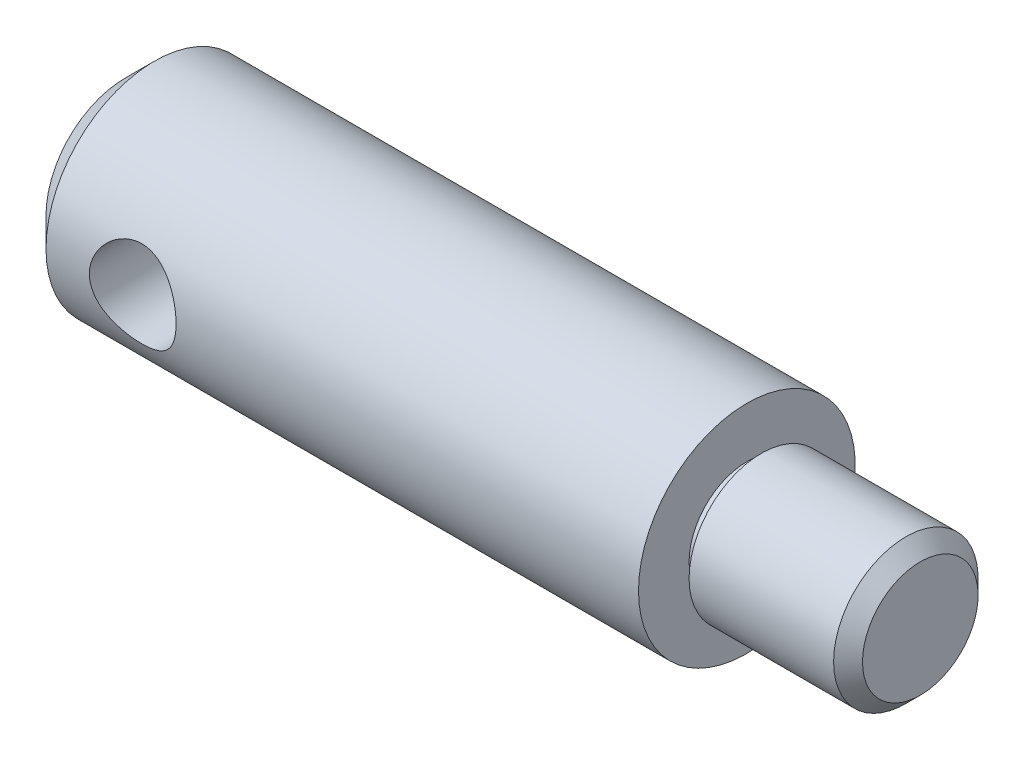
ISO-10303-21;
HEADER;
FILE_DESCRIPTION(('STEP AP214'),'2;1');
FILE_NAME('part.step','',(''),(''),'','','');
FILE_SCHEMA(('AUTOMOTIVE_DESIGN { 1 0 10303 214 1 1 1 1 }'));
ENDSEC;
DATA;
#1=APPLICATION_CONTEXT('core data for automotive mechanical design processes');
#2=APPLICATION_PROTOCOL_DEFINITION('international standard','automotive_design',2000,#1);
#3=PRODUCT_CONTEXT('',#1,'mechanical');
#4=PRODUCT('Part','Part','',(#3));
#5=PRODUCT_RELATED_PRODUCT_CATEGORY('part','',(#4));
#6=PRODUCT_DEFINITION_FORMATION('','',#4);
#7=PRODUCT_DEFINITION_CONTEXT('part definition',#1,'design');
#8=PRODUCT_DEFINITION('design','',#6,#7);
#9=PRODUCT_DEFINITION_SHAPE('','',#8);
#10=(LENGTH_UNIT() NAMED_UNIT(*) SI_UNIT(.MILLI.,.METRE.));
#11=(NAMED_UNIT(*) PLANE_ANGLE_UNIT() SI_UNIT($,.RADIAN.));
#12=(NAMED_UNIT(*) SI_UNIT($,.STERADIAN.) SOLID_ANGLE_UNIT());
#13=UNCERTAINTY_MEASURE_WITH_UNIT(LENGTH_MEASURE(1.E-05),#10,'distance_accuracy_value','');
#14=(GEOMETRIC_REPRESENTATION_CONTEXT(3) GLOBAL_UNCERTAINTY_ASSIGNED_CONTEXT((#13)) GLOBAL_UNIT_ASSIGNED_CONTEXT((#10,
#11,#12)) REPRESENTATION_CONTEXT('',''));
#15=CARTESIAN_POINT('',(0.,0.,0.));
#16=DIRECTION('',(0.,0.,1.));
#17=DIRECTION('',(1.,0.,0.));
#18=AXIS2_PLACEMENT_3D('',#15,#16,#17);
#19=CARTESIAN_POINT('',(55.,0.,0.));
#20=DIRECTION('',(-1.,0.,0.));
#21=DIRECTION('',(0.,0.,1.));
#22=AXIS2_PLACEMENT_3D('',#19,#20,#21);
#23=PLANE('',#22);
#24=CARTESIAN_POINT('',(55.,0.,0.));
#25=DIRECTION('',(-1.,0.,0.));
#26=DIRECTION('',(0.,0.,1.));
#27=AXIS2_PLACEMENT_3D('',#24,#25,#26);
#28=CIRCLE('',#27,3.99999999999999);
#29=CARTESIAN_POINT('',(55.,0.,3.99999999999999));
#30=VERTEX_POINT('',#29);
#31=EDGE_CURVE('E362',#30,#30,#28,.T.);
#32=ORIENTED_EDGE('',*,*,#31,.F.);
#33=EDGE_LOOP('',(#32));
#34=FACE_BOUND('',#33,.T.);
#35=ADVANCED_FACE('F348',(#34),#23,.F.);
#36=CARTESIAN_POINT('',(55.,0.,0.));
#37=DIRECTION('',(-1.,0.,0.));
#38=DIRECTION('',(0.,0.,1.));
#39=AXIS2_PLACEMENT_3D('',#36,#37,#38);
#40=CONICAL_SURFACE('',#39,3.99999999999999,0.78539816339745);
#41=CARTESIAN_POINT('',(54.,0.,0.));
#42=DIRECTION('',(-1.,0.,0.));
#43=DIRECTION('',(0.,0.,1.));
#44=AXIS2_PLACEMENT_3D('',#41,#42,#43);
#45=CIRCLE('',#44,4.99999999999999);
#46=CARTESIAN_POINT('',(54.,0.,4.99999999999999));
#47=VERTEX_POINT('',#46);
#48=EDGE_CURVE('E366',#47,#47,#45,.T.);
#49=ORIENTED_EDGE('',*,*,#48,.F.);
#50=EDGE_LOOP('',(#49));
#51=FACE_BOUND('',#50,.T.);
#52=ORIENTED_EDGE('',*,*,#31,.T.);
#53=EDGE_LOOP('',(#52));
#54=FACE_BOUND('',#53,.T.);
#55=ADVANCED_FACE('F394',(#51,#54),#40,.T.);
#56=CARTESIAN_POINT('',(-44.,0.,0.));
#57=DIRECTION('',(-1.,0.,0.));
#58=DIRECTION('',(0.,0.,1.));
#59=AXIS2_PLACEMENT_3D('',#56,#57,#58);
#60=CYLINDRICAL_SURFACE('',#59,4.99999999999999);
#61=CARTESIAN_POINT('',(44.,0.,0.));
#62=DIRECTION('',(-1.,0.,0.));
#63=DIRECTION('',(0.,0.,1.));
#64=AXIS2_PLACEMENT_3D('',#61,#62,#63);
#65=CIRCLE('',#64,4.99999999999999);
#66=CARTESIAN_POINT('',(44.,0.,4.99999999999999));
#67=VERTEX_POINT('',#66);
#68=EDGE_CURVE('E431',#67,#67,#65,.T.);
#69=ORIENTED_EDGE('',*,*,#68,.F.);
#70=EDGE_LOOP('',(#69));
#71=FACE_BOUND('',#70,.T.);
#72=ORIENTED_EDGE('',*,*,#48,.T.);
#73=EDGE_LOOP('',(#72));
#74=FACE_BOUND('',#73,.T.);
#75=ADVANCED_FACE('F399',(#71,#74),#60,.T.);
#76=CARTESIAN_POINT('',(44.,4.99999999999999,0.));
#77=DIRECTION('',(1.,0.,0.));
#78=DIRECTION('',(0.,0.,-1.));
#79=AXIS2_PLACEMENT_3D('',#76,#77,#78);
#80=PLANE('',#79);
#81=CARTESIAN_POINT('',(44.,0.,0.));
#82=DIRECTION('',(-1.,0.,0.));
#83=DIRECTION('',(0.,0.,1.));
#84=AXIS2_PLACEMENT_3D('',#81,#82,#83);
#85=CIRCLE('',#84,3.99999999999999);
#86=CARTESIAN_POINT('',(44.,0.,3.99999999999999));
#87=VERTEX_POINT('',#86);
#88=EDGE_CURVE('E428',#87,#87,#85,.T.);
#89=ORIENTED_EDGE('',*,*,#88,.F.);
#90=EDGE_LOOP('',(#89));
#91=FACE_BOUND('',#90,.T.);
#92=ORIENTED_EDGE('',*,*,#68,.T.);
#93=EDGE_LOOP('',(#92));
#94=FACE_BOUND('',#93,.T.);
#95=ADVANCED_FACE('F406',(#91,#94),#80,.F.);
#96=CARTESIAN_POINT('',(-44.,0.,0.));
#97=DIRECTION('',(-1.,0.,0.));
#98=DIRECTION('',(0.,0.,1.));
#99=AXIS2_PLACEMENT_3D('',#96,#97,#98);
#100=CYLINDRICAL_SURFACE('',#99,3.99999999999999);
#101=CARTESIAN_POINT('',(43.,0.,0.));
#102=DIRECTION('',(-1.,0.,0.));
#103=DIRECTION('',(0.,0.,1.));
#104=AXIS2_PLACEMENT_3D('',#101,#102,#103);
#105=CIRCLE('',#104,3.99999999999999);
#106=CARTESIAN_POINT('',(43.,0.,3.99999999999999));
#107=VERTEX_POINT('',#106);
#108=EDGE_CURVE('E427',#107,#107,#105,.T.);
#109=ORIENTED_EDGE('',*,*,#108,.F.);
#110=EDGE_LOOP('',(#109));
#111=FACE_BOUND('',#110,.T.);
#112=ORIENTED_EDGE('',*,*,#88,.T.);
#113=EDGE_LOOP('',(#112));
#114=FACE_BOUND('',#113,.T.);
#115=ADVANCED_FACE('F413',(#111,#114),#100,.T.);
#116=CARTESIAN_POINT('',(43.,3.99999999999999,0.));
#117=DIRECTION('',(-1.,0.,0.));
#118=DIRECTION('',(0.,0.,1.));
#119=AXIS2_PLACEMENT_3D('',#116,#117,#118);
#120=PLANE('',#119);
#121=CARTESIAN_POINT('',(43.,0.,0.));
#122=DIRECTION('',(-1.,0.,0.));
#123=DIRECTION('',(0.,0.,1.));
#124=AXIS2_PLACEMENT_3D('',#121,#122,#123);
#125=CIRCLE('',#124,7.5);
#126=CARTESIAN_POINT('',(43.,0.,7.5));
#127=VERTEX_POINT('',#126);
#128=EDGE_CURVE('E424',#127,#127,#125,.T.);
#129=ORIENTED_EDGE('',*,*,#128,.F.);
#130=EDGE_LOOP('',(#129));
#131=FACE_BOUND('',#130,.T.);
#132=ORIENTED_EDGE('',*,*,#108,.T.);
#133=EDGE_LOOP('',(#132));
#134=FACE_BOUND('',#133,.T.);
#135=ADVANCED_FACE('F390',(#131,#134),#120,.F.);
#136=CARTESIAN_POINT('',(-44.,0.,0.));
#137=DIRECTION('',(-1.,0.,0.));
#138=DIRECTION('',(0.,0.,1.));
#139=AXIS2_PLACEMENT_3D('',#136,#137,#138);
#140=CYLINDRICAL_SURFACE('',#139,7.5);
#141=CARTESIAN_POINT('',(11.,0.,-7.5));
#142=CARTESIAN_POINT('',(10.9999983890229,0.0806632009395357,-7.49999888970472));
#143=CARTESIAN_POINT('',(10.99674011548,0.161354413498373,-7.4986936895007));
#144=CARTESIAN_POINT('',(10.9837470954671,0.322146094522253,-7.49351186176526));
#145=CARTESIAN_POINT('',(10.9740082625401,0.402246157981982,-7.48963361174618));
#146=CARTESIAN_POINT('',(10.9351288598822,0.641096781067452,-7.47424634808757));
#147=CARTESIAN_POINT('',(10.8963256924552,0.798158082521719,-7.45898522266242));
#148=CARTESIAN_POINT('',(10.7946857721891,1.10247033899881,-7.42011459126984));
#149=CARTESIAN_POINT('',(10.7319277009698,1.24975157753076,-7.39653243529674));
#150=CARTESIAN_POINT('',(10.584471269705,1.53159737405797,-7.34334877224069));
#151=CARTESIAN_POINT('',(10.4997805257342,1.66616632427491,-7.31374935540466));
#152=CARTESIAN_POINT('',(10.3066467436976,1.92525452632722,-7.24996340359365));
#153=CARTESIAN_POINT('',(10.1973400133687,2.04909421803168,-7.21563448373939));
#154=CARTESIAN_POINT('',(9.95989999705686,2.27726169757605,-7.14690862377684));
#155=CARTESIAN_POINT('',(9.8317575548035,2.38157993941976,-7.11251165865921));
#156=CARTESIAN_POINT('',(9.55335789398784,2.5723120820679,-7.04584188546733));
#157=CARTESIAN_POINT('',(9.40237027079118,2.65772253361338,-7.01373174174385));
#158=CARTESIAN_POINT('',(9.08669540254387,2.80163201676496,-6.95750470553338));
#159=CARTESIAN_POINT('',(8.9220147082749,2.86014383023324,-6.93338401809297));
#160=CARTESIAN_POINT('',(8.59143149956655,2.94584825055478,-6.8973953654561));
#161=CARTESIAN_POINT('',(8.42592314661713,2.974340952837,-6.88502130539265));
#162=CARTESIAN_POINT('',(8.09204750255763,3.00325943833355,-6.87246006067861));
#163=CARTESIAN_POINT('',(7.92368165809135,3.00369902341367,-6.87226688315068));
#164=CARTESIAN_POINT('',(7.60136499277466,2.97748405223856,-6.88365750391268));
#165=CARTESIAN_POINT('',(7.44722642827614,2.95271297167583,-6.89442262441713));
#166=CARTESIAN_POINT('',(7.14551066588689,2.87992032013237,-6.92514281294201));
#167=CARTESIAN_POINT('',(6.99793461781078,2.83189469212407,-6.94509948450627));
#168=CARTESIAN_POINT('',(6.70997324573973,2.71304209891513,-6.99239227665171));
#169=CARTESIAN_POINT('',(6.56979614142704,2.64176979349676,-7.01987068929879));
#170=CARTESIAN_POINT('',(6.30287627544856,2.47875969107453,-7.07907174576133));
#171=CARTESIAN_POINT('',(6.17613858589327,2.38701420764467,-7.1107959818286));
#172=CARTESIAN_POINT('',(5.92938540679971,2.17732589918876,-7.17790105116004));
#173=CARTESIAN_POINT('',(5.8106469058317,2.05790619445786,-7.21337497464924));
#174=CARTESIAN_POINT('',(5.59447328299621,1.80047164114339,-7.28189737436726));
#175=CARTESIAN_POINT('',(5.49704240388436,1.66245309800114,-7.31494536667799));
#176=CARTESIAN_POINT('',(5.32457382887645,1.36811647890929,-7.37572021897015));
#177=CARTESIAN_POINT('',(5.25001657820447,1.21149073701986,-7.40332905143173));
#178=CARTESIAN_POINT('',(5.12874820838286,0.886535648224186,-7.44922242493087));
#179=CARTESIAN_POINT('',(5.08202294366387,0.718212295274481,-7.4675117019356));
#180=CARTESIAN_POINT('',(5.02032755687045,0.385343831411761,-7.49184209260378));
#181=CARTESIAN_POINT('',(5.00364131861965,0.221164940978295,-7.49854418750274));
#182=CARTESIAN_POINT('',(4.99743034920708,-0.107767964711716,-7.50102717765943));
#183=CARTESIAN_POINT('',(5.00789857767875,-0.272521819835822,-7.49681090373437));
#184=CARTESIAN_POINT('',(5.05443762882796,-0.59014910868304,-7.4783635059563));
#185=CARTESIAN_POINT('',(5.08933697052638,-0.743223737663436,-7.46459087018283));
#186=CARTESIAN_POINT('',(5.18215356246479,-1.04120314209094,-7.42889162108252));
#187=CARTESIAN_POINT('',(5.24007376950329,-1.18610686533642,-7.40696396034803));
#188=CARTESIAN_POINT('',(5.37917740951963,-1.46861817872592,-7.3562489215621));
#189=CARTESIAN_POINT('',(5.46101820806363,-1.60586703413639,-7.32727223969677));
#190=CARTESIAN_POINT('',(5.64491048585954,-1.86516538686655,-7.26560047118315));
#191=CARTESIAN_POINT('',(5.74697006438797,-1.98720876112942,-7.23290389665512));
#192=CARTESIAN_POINT('',(5.97630501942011,-2.2210845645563,-7.16467676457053));
#193=CARTESIAN_POINT('',(6.10480031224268,-2.33171090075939,-7.12910162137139));
#194=CARTESIAN_POINT('',(6.37916012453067,-2.53012679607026,-7.06112509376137));
#195=CARTESIAN_POINT('',(6.5250275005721,-2.6179125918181,-7.02872423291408));
#196=CARTESIAN_POINT('',(6.83219254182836,-2.76871125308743,-6.97071449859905));
#197=CARTESIAN_POINT('',(6.99362599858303,-2.83147589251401,-6.94517446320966));
#198=CARTESIAN_POINT('',(7.32610047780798,-2.92844432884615,-6.90485510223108));
#199=CARTESIAN_POINT('',(7.4971343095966,-2.96266920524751,-6.89006783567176));
#200=CARTESIAN_POINT('',(7.83069185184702,-2.9995734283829,-6.87407638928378));
#201=CARTESIAN_POINT('',(7.99294225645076,-3.00434563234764,-6.87197131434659));
#202=CARTESIAN_POINT('',(8.31581728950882,-2.98770473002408,-6.87922254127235));
#203=CARTESIAN_POINT('',(8.47644212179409,-2.96629494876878,-6.88857738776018));
#204=CARTESIAN_POINT('',(8.78499827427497,-2.89960708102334,-6.91689973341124));
#205=CARTESIAN_POINT('',(8.93318037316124,-2.85530635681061,-6.93547246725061));
#206=CARTESIAN_POINT('',(9.2200679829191,-2.7450080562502,-6.97986002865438));
#207=CARTESIAN_POINT('',(9.35877086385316,-2.67900448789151,-7.00567685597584));
#208=CARTESIAN_POINT('',(9.63141427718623,-2.52280960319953,-7.06347910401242));
#209=CARTESIAN_POINT('',(9.76462742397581,-2.43144976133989,-7.09573308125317));
#210=CARTESIAN_POINT('',(10.014490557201,-2.2288364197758,-7.16195721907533));
#211=CARTESIAN_POINT('',(10.1311355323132,-2.1175769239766,-7.1959278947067));
#212=CARTESIAN_POINT('',(10.3523019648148,-1.86976526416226,-7.26440289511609));
#213=CARTESIAN_POINT('',(10.4555470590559,-1.73204093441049,-7.29879901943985));
#214=CARTESIAN_POINT('',(10.6375144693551,-1.43982353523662,-7.36200845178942));
#215=CARTESIAN_POINT('',(10.7162253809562,-1.28532271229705,-7.39081916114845));
#216=CARTESIAN_POINT('',(10.8130735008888,-1.04589046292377,-7.42714827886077));
#217=CARTESIAN_POINT('',(10.841655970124,-0.965550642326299,-7.438042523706));
#218=CARTESIAN_POINT('',(10.8919376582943,-0.802472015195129,-7.45739623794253));
#219=CARTESIAN_POINT('',(10.9136400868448,-0.719734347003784,-7.46585684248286));
#220=CARTESIAN_POINT('',(10.9498820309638,-0.552707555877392,-7.48007543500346));
#221=CARTESIAN_POINT('',(10.9644397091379,-0.468422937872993,-7.48584027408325));
#222=CARTESIAN_POINT('',(10.9863036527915,-0.298814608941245,-7.49452509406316));
#223=CARTESIAN_POINT('',(10.9936150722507,-0.213491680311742,-7.49744709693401));
#224=CARTESIAN_POINT('',(10.9990895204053,-0.0853730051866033,-7.49963590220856));
#225=CARTESIAN_POINT('',(11.0000008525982,-0.0426904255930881,-7.50000058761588));
#226=CARTESIAN_POINT('',(11.,0.,-7.5));
#227=B_SPLINE_CURVE_WITH_KNOTS('',3,(#141,#142,#143,#144,#145,#146,#147,#148,#149,#150,#151,
#152,#153,#154,#155,#156,#157,#158,#159,#160,#161,#162,#163,#164,#165,#166,#167,#168,#169,#170,
#171,#172,#173,#174,#175,#176,#177,#178,#179,#180,#181,#182,#183,#184,#185,#186,#187,#188,#189,
#190,#191,#192,#193,#194,#195,#196,#197,#198,#199,#200,#201,#202,#203,#204,#205,#206,#207,#208,
#209,#210,#211,#212,#213,#214,#215,#216,#217,#218,#219,#220,#221,#222,#223,#224,#225,#226),
.UNSPECIFIED.,.T.,.F.,(4,2,2,2,2,2,2,2,2,2,2,2,2,2,2,2,2,2,2,2,2,2,2,2,2,2,2,2,2,2,2,2,2,2,2,2,
2,2,2,2,2,2,4),(0.,0.241952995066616,0.484058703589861,0.968979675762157,1.45232140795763,
1.93549552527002,2.43941494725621,2.94358014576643,3.47018310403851,3.99653556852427,
4.49901580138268,5.00124881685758,5.46852914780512,5.93589103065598,6.4127911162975,
6.88987055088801,7.40382945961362,7.91789061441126,8.44210791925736,8.96605856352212,
9.45899198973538,9.9517976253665,10.4224610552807,10.8931849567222,11.3783069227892,
11.8636236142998,12.3809813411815,12.8984242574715,13.4208798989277,13.9429493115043,
14.4274493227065,14.911887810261,15.3771690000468,15.8425787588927,16.3346362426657,
16.8268422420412,17.3509605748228,17.8753221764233,18.1329380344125,18.3904335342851,
18.6472710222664,18.9039257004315,19.0319776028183),.UNSPECIFIED.);
#228=CARTESIAN_POINT('',(11.,0.,-7.5));
#229=VERTEX_POINT('',#228);
#230=EDGE_CURVE('E10',#229,#229,#227,.T.);
#231=ORIENTED_EDGE('',*,*,#230,.T.);
#232=EDGE_LOOP('',(#231));
#233=FACE_BOUND('',#232,.T.);
#234=CARTESIAN_POINT('',(11.,0.,7.5));
#235=CARTESIAN_POINT('',(10.9999983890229,-0.0806632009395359,7.49999888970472));
#236=CARTESIAN_POINT('',(10.99674011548,-0.161354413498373,7.4986936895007));
#237=CARTESIAN_POINT('',(10.9837470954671,-0.322146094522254,7.49351186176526));
#238=CARTESIAN_POINT('',(10.9740082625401,-0.402246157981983,7.48963361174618));
#239=CARTESIAN_POINT('',(10.9351288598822,-0.641096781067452,7.47424634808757));
#240=CARTESIAN_POINT('',(10.8963256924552,-0.79815808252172,7.45898522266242));
#241=CARTESIAN_POINT('',(10.7946857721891,-1.10247033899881,7.42011459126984));
#242=CARTESIAN_POINT('',(10.7319277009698,-1.24975157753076,7.39653243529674));
#243=CARTESIAN_POINT('',(10.584471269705,-1.53159737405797,7.34334877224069));
#244=CARTESIAN_POINT('',(10.4997805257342,-1.66616632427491,7.31374935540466));
#245=CARTESIAN_POINT('',(10.3066467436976,-1.92525452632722,7.24996340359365));
#246=CARTESIAN_POINT('',(10.1973400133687,-2.04909421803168,7.21563448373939));
#247=CARTESIAN_POINT('',(9.95989999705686,-2.27726169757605,7.14690862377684));
#248=CARTESIAN_POINT('',(9.8317575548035,-2.38157993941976,7.11251165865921));
#249=CARTESIAN_POINT('',(9.55335789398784,-2.5723120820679,7.04584188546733));
#250=CARTESIAN_POINT('',(9.40237027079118,-2.65772253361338,7.01373174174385));
#251=CARTESIAN_POINT('',(9.08669540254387,-2.80163201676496,6.95750470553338));
#252=CARTESIAN_POINT('',(8.9220147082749,-2.86014383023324,6.93338401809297));
#253=CARTESIAN_POINT('',(8.59143149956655,-2.94584825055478,6.8973953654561));
#254=CARTESIAN_POINT('',(8.42592314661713,-2.974340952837,6.88502130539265));
#255=CARTESIAN_POINT('',(8.09204750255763,-3.00325943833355,6.87246006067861));
#256=CARTESIAN_POINT('',(7.92368165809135,-3.00369902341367,6.87226688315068));
#257=CARTESIAN_POINT('',(7.60136499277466,-2.97748405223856,6.88365750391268));
#258=CARTESIAN_POINT('',(7.44722642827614,-2.95271297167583,6.89442262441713));
#259=CARTESIAN_POINT('',(7.14551066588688,-2.87992032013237,6.92514281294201));
#260=CARTESIAN_POINT('',(6.99793461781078,-2.83189469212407,6.94509948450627));
#261=CARTESIAN_POINT('',(6.70997324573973,-2.71304209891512,6.99239227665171));
#262=CARTESIAN_POINT('',(6.56979614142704,-2.64176979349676,7.01987068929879));
#263=CARTESIAN_POINT('',(6.30287627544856,-2.47875969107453,7.07907174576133));
#264=CARTESIAN_POINT('',(6.17613858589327,-2.38701420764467,7.1107959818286));
#265=CARTESIAN_POINT('',(5.92938540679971,-2.17732589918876,7.17790105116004));
#266=CARTESIAN_POINT('',(5.8106469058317,-2.05790619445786,7.21337497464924));
#267=CARTESIAN_POINT('',(5.59447328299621,-1.80047164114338,7.28189737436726));
#268=CARTESIAN_POINT('',(5.49704240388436,-1.66245309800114,7.31494536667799));
#269=CARTESIAN_POINT('',(5.32457382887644,-1.36811647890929,7.37572021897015));
#270=CARTESIAN_POINT('',(5.25001657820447,-1.21149073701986,7.40332905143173));
#271=CARTESIAN_POINT('',(5.12874820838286,-0.886535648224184,7.44922242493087));
#272=CARTESIAN_POINT('',(5.08202294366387,-0.71821229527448,7.4675117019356));
#273=CARTESIAN_POINT('',(5.02032755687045,-0.38534383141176,7.49184209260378));
#274=CARTESIAN_POINT('',(5.00364131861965,-0.221164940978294,7.49854418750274));
#275=CARTESIAN_POINT('',(4.99743034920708,0.107767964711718,7.50102717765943));
#276=CARTESIAN_POINT('',(5.00789857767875,0.272521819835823,7.49681090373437));
#277=CARTESIAN_POINT('',(5.05443762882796,0.590149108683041,7.4783635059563));
#278=CARTESIAN_POINT('',(5.08933697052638,0.743223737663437,7.46459087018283));
#279=CARTESIAN_POINT('',(5.18215356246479,1.04120314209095,7.42889162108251));
#280=CARTESIAN_POINT('',(5.24007376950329,1.18610686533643,7.40696396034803));
#281=CARTESIAN_POINT('',(5.37917740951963,1.46861817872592,7.3562489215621));
#282=CARTESIAN_POINT('',(5.46101820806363,1.60586703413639,7.32727223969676));
#283=CARTESIAN_POINT('',(5.64491048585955,1.86516538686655,7.26560047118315));
#284=CARTESIAN_POINT('',(5.74697006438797,1.98720876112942,7.23290389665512));
#285=CARTESIAN_POINT('',(5.97630501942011,2.2210845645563,7.16467676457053));
#286=CARTESIAN_POINT('',(6.10480031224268,2.3317109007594,7.12910162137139));
#287=CARTESIAN_POINT('',(6.37916012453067,2.53012679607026,7.06112509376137));
#288=CARTESIAN_POINT('',(6.5250275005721,2.6179125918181,7.02872423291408));
#289=CARTESIAN_POINT('',(6.83219254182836,2.76871125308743,6.97071449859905));
#290=CARTESIAN_POINT('',(6.99362599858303,2.83147589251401,6.94517446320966));
#291=CARTESIAN_POINT('',(7.32610047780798,2.92844432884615,6.90485510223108));
#292=CARTESIAN_POINT('',(7.4971343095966,2.96266920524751,6.89006783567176));
#293=CARTESIAN_POINT('',(7.83069185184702,2.9995734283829,6.87407638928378));
#294=CARTESIAN_POINT('',(7.99294225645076,3.00434563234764,6.87197131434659));
#295=CARTESIAN_POINT('',(8.31581728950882,2.98770473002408,6.87922254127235));
#296=CARTESIAN_POINT('',(8.47644212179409,2.96629494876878,6.88857738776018));
#297=CARTESIAN_POINT('',(8.78499827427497,2.89960708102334,6.91689973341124));
#298=CARTESIAN_POINT('',(8.93318037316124,2.85530635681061,6.93547246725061));
#299=CARTESIAN_POINT('',(9.2200679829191,2.7450080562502,6.97986002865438));
#300=CARTESIAN_POINT('',(9.35877086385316,2.67900448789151,7.00567685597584));
#301=CARTESIAN_POINT('',(9.63141427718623,2.52280960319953,7.06347910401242));
#302=CARTESIAN_POINT('',(9.76462742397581,2.43144976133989,7.09573308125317));
#303=CARTESIAN_POINT('',(10.014490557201,2.2288364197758,7.16195721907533));
#304=CARTESIAN_POINT('',(10.1311355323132,2.1175769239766,7.1959278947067));
#305=CARTESIAN_POINT('',(10.3523019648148,1.86976526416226,7.26440289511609));
#306=CARTESIAN_POINT('',(10.4555470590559,1.73204093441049,7.29879901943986));
#307=CARTESIAN_POINT('',(10.6375144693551,1.43982353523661,7.36200845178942));
#308=CARTESIAN_POINT('',(10.7162253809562,1.28532271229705,7.39081916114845));
#309=CARTESIAN_POINT('',(10.8130735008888,1.04589046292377,7.42714827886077));
#310=CARTESIAN_POINT('',(10.841655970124,0.965550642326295,7.438042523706));
#311=CARTESIAN_POINT('',(10.8919376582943,0.802472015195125,7.45739623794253));
#312=CARTESIAN_POINT('',(10.9136400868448,0.71973434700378,7.46585684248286));
#313=CARTESIAN_POINT('',(10.9498820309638,0.552707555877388,7.48007543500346));
#314=CARTESIAN_POINT('',(10.9644397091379,0.46842293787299,7.48584027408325));
#315=CARTESIAN_POINT('',(10.9863036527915,0.298814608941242,7.49452509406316));
#316=CARTESIAN_POINT('',(10.9936150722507,0.213491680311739,7.49744709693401));
#317=CARTESIAN_POINT('',(10.9990895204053,0.0853730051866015,7.49963590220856));
#318=CARTESIAN_POINT('',(11.0000008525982,0.0426904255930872,7.50000058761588));
#319=CARTESIAN_POINT('',(11.,0.,7.5));
#320=B_SPLINE_CURVE_WITH_KNOTS('',3,(#234,#235,#236,#237,#238,#239,#240,#241,#242,#243,#244,
#245,#246,#247,#248,#249,#250,#251,#252,#253,#254,#255,#256,#257,#258,#259,#260,#261,#262,#263,
#264,#265,#266,#267,#268,#269,#270,#271,#272,#273,#274,#275,#276,#277,#278,#279,#280,#281,#282,
#283,#284,#285,#286,#287,#288,#289,#290,#291,#292,#293,#294,#295,#296,#297,#298,#299,#300,#301,
#302,#303,#304,#305,#306,#307,#308,#309,#310,#311,#312,#313,#314,#315,#316,#317,#318,#319),
.UNSPECIFIED.,.T.,.F.,(4,2,2,2,2,2,2,2,2,2,2,2,2,2,2,2,2,2,2,2,2,2,2,2,2,2,2,2,2,2,2,2,2,2,2,2,
2,2,2,2,2,2,4),(0.,0.241952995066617,0.484058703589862,0.968979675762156,1.45232140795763,
1.93549552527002,2.43941494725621,2.94358014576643,3.47018310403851,3.99653556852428,
4.49901580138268,5.00124881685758,5.46852914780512,5.93589103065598,6.4127911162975,
6.88987055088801,7.40382945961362,7.91789061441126,8.44210791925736,8.96605856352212,
9.45899198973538,9.9517976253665,10.4224610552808,10.8931849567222,11.3783069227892,
11.8636236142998,12.3809813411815,12.8984242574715,13.4208798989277,13.9429493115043,
14.4274493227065,14.911887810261,15.3771690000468,15.8425787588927,16.3346362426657,
16.8268422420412,17.3509605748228,17.8753221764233,18.1329380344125,18.3904335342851,
18.6472710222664,18.9039257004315,19.0319776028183),.UNSPECIFIED.);
#321=CARTESIAN_POINT('',(11.,0.,7.5));
#322=VERTEX_POINT('',#321);
#323=EDGE_CURVE('E358',#322,#322,#320,.T.);
#324=ORIENTED_EDGE('',*,*,#323,.T.);
#325=EDGE_LOOP('',(#324));
#326=FACE_BOUND('',#325,.T.);
#327=CARTESIAN_POINT('',(2.,0.,0.));
#328=DIRECTION('',(-1.,0.,0.));
#329=DIRECTION('',(0.,0.,1.));
#330=AXIS2_PLACEMENT_3D('',#327,#328,#329);
#331=CIRCLE('',#330,7.5);
#332=CARTESIAN_POINT('',(2.,0.,7.5));
#333=VERTEX_POINT('',#332);
#334=EDGE_CURVE('E433',#333,#333,#331,.T.);
#335=ORIENTED_EDGE('',*,*,#334,.F.);
#336=EDGE_LOOP('',(#335));
#337=FACE_BOUND('',#336,.T.);
#338=ORIENTED_EDGE('',*,*,#128,.T.);
#339=EDGE_LOOP('',(#338));
#340=FACE_BOUND('',#339,.T.);
#341=ADVANCED_FACE('F371',(#233,#326,#337,#340),#140,.T.);
#342=CARTESIAN_POINT('',(2.,0.,0.));
#343=DIRECTION('',(1.,0.,0.));
#344=DIRECTION('',(0.,0.,-1.));
#345=AXIS2_PLACEMENT_3D('',#342,#343,#344);
#346=CONICAL_SURFACE('',#345,7.5,0.78539816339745);
#347=CARTESIAN_POINT('',(0.,0.,0.));
#348=DIRECTION('',(-1.,0.,0.));
#349=DIRECTION('',(0.,0.,1.));
#350=AXIS2_PLACEMENT_3D('',#347,#348,#349);
#351=CIRCLE('',#350,5.49999999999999);
#352=CARTESIAN_POINT('',(0.,0.,5.49999999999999));
#353=VERTEX_POINT('',#352);
#354=EDGE_CURVE('E444',#353,#353,#351,.T.);
#355=ORIENTED_EDGE('',*,*,#354,.F.);
#356=EDGE_LOOP('',(#355));
#357=FACE_BOUND('',#356,.T.);
#358=ORIENTED_EDGE('',*,*,#334,.T.);
#359=EDGE_LOOP('',(#358));
#360=FACE_BOUND('',#359,.T.);
#361=ADVANCED_FACE('F383',(#357,#360),#346,.T.);
#362=CARTESIAN_POINT('',(0.,5.49999999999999,0.));
#363=DIRECTION('',(1.,0.,0.));
#364=DIRECTION('',(0.,0.,-1.));
#365=AXIS2_PLACEMENT_3D('',#362,#363,#364);
#366=PLANE('',#365);
#367=ORIENTED_EDGE('',*,*,#354,.T.);
#368=EDGE_LOOP('',(#367));
#369=FACE_BOUND('',#368,.T.);
#370=ADVANCED_FACE('F379',(#369),#366,.F.);
#371=CARTESIAN_POINT('',(7.99999999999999,0.,-7.5));
#372=DIRECTION('',(0.,0.,1.));
#373=DIRECTION('',(1.,0.,0.));
#374=AXIS2_PLACEMENT_3D('',#371,#372,#373);
#375=CYLINDRICAL_SURFACE('',#374,3.);
#376=ORIENTED_EDGE('',*,*,#230,.F.);
#377=EDGE_LOOP('',(#376));
#378=FACE_BOUND('',#377,.T.);
#379=ORIENTED_EDGE('',*,*,#323,.F.);
#380=EDGE_LOOP('',(#379));
#381=FACE_BOUND('',#380,.T.);
#382=ADVANCED_FACE('F375',(#378,#381),#375,.F.);
#383=CLOSED_SHELL('',(#35,#55,#75,#95,#115,#135,#341,#361,#370,#382));
#384=MANIFOLD_SOLID_BREP('B2',#383);
#385=ADVANCED_BREP_SHAPE_REPRESENTATION('',(#18,#384),#14);
#386=SHAPE_DEFINITION_REPRESENTATION(#9,#385);
ENDSEC;
END-ISO-10303-21;
